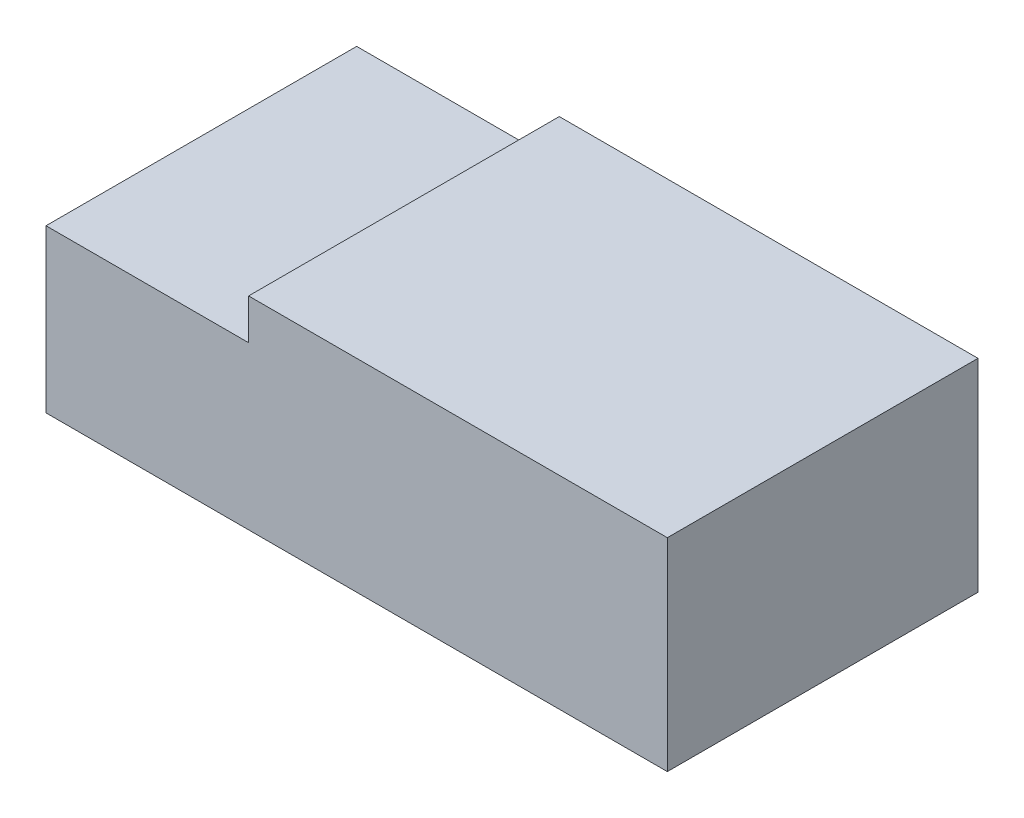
from build123d import *

# Parameters (mm, degrees)
SKETCH1_W           = 230
SKETCH1_H           = 115
BOSS_EXTRUDE1_DEPTH = 37.5
SKETCH2_W           = 75
SKETCH2_H           = 115
CUT_EXTRUDE1_DEPTH  = 15


with BuildPart() as part:
    # Sketch1 → Boss-Extrude1 (new, symmetric)
    with BuildSketch(Plane(origin=(0, 0, 0), x_dir=(1, 0, 0), z_dir=(0, 1, 0))):
        Rectangle(SKETCH1_W, SKETCH1_H)
    extrude(amount=BOSS_EXTRUDE1_DEPTH, both=True)

    # Sketch2 → Cut-Extrude1 (cut)
    with BuildSketch(Plane(origin=(0, 37.5, 0), x_dir=(1, 0, 0), z_dir=(0, 1, 0))):
        with Locations((-77.5, 0)):
            Rectangle(SKETCH2_W, SKETCH2_H)
    extrude(amount=-CUT_EXTRUDE1_DEPTH, mode=Mode.SUBTRACT)


solid = part.part
